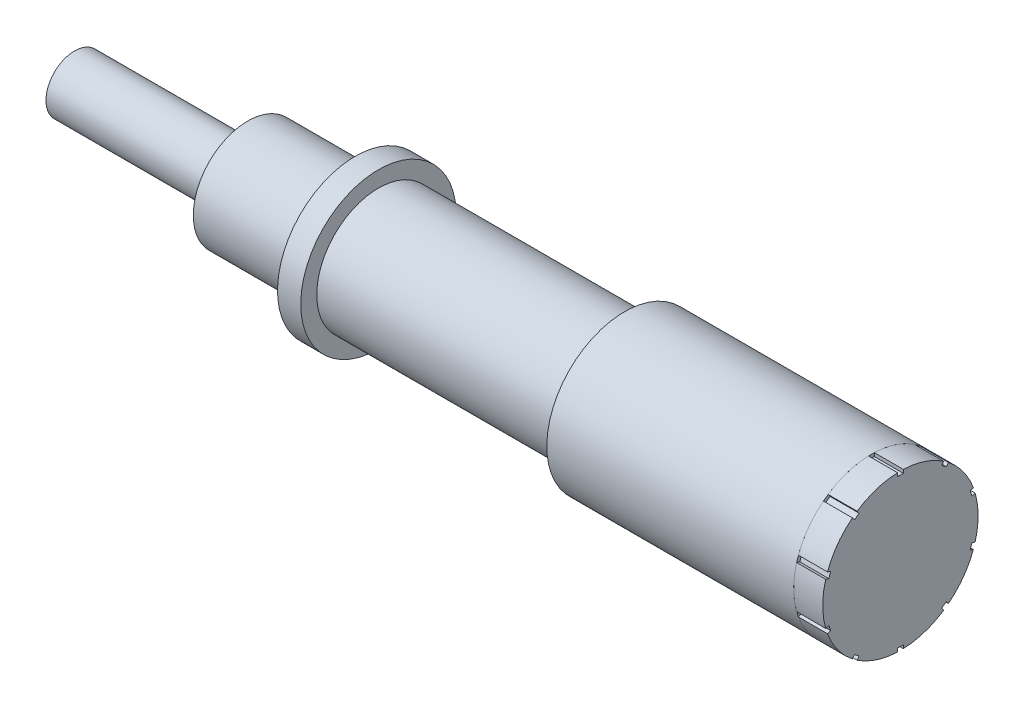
ISO-10303-21;
HEADER;
FILE_DESCRIPTION(('STEP AP214'),'2;1');
FILE_NAME('part.step','',(''),(''),'','','');
FILE_SCHEMA(('AUTOMOTIVE_DESIGN { 1 0 10303 214 1 1 1 1 }'));
ENDSEC;
DATA;
#1=APPLICATION_CONTEXT('core data for automotive mechanical design processes');
#2=APPLICATION_PROTOCOL_DEFINITION('international standard','automotive_design',2000,#1);
#3=PRODUCT_CONTEXT('',#1,'mechanical');
#4=PRODUCT('Part','Part','',(#3));
#5=PRODUCT_RELATED_PRODUCT_CATEGORY('part','',(#4));
#6=PRODUCT_DEFINITION_FORMATION('','',#4);
#7=PRODUCT_DEFINITION_CONTEXT('part definition',#1,'design');
#8=PRODUCT_DEFINITION('design','',#6,#7);
#9=PRODUCT_DEFINITION_SHAPE('','',#8);
#10=(LENGTH_UNIT() NAMED_UNIT(*) SI_UNIT(.MILLI.,.METRE.));
#11=(NAMED_UNIT(*) PLANE_ANGLE_UNIT() SI_UNIT($,.RADIAN.));
#12=(NAMED_UNIT(*) SI_UNIT($,.STERADIAN.) SOLID_ANGLE_UNIT());
#13=UNCERTAINTY_MEASURE_WITH_UNIT(LENGTH_MEASURE(1.E-05),#10,'distance_accuracy_value','');
#14=(GEOMETRIC_REPRESENTATION_CONTEXT(3) GLOBAL_UNCERTAINTY_ASSIGNED_CONTEXT((#13)) GLOBAL_UNIT_ASSIGNED_CONTEXT((#10,
#11,#12)) REPRESENTATION_CONTEXT('',''));
#15=CARTESIAN_POINT('',(0.,0.,0.));
#16=DIRECTION('',(0.,0.,1.));
#17=DIRECTION('',(1.,0.,0.));
#18=AXIS2_PLACEMENT_3D('',#15,#16,#17);
#19=CARTESIAN_POINT('',(63.4238,0.,0.));
#20=DIRECTION('',(-1.,0.,0.));
#21=DIRECTION('',(0.,0.,1.));
#22=AXIS2_PLACEMENT_3D('',#19,#20,#21);
#23=CYLINDRICAL_SURFACE('',#22,6.7945);
#24=CARTESIAN_POINT('',(63.4238,0.,0.));
#25=DIRECTION('',(1.,0.,0.));
#26=DIRECTION('',(0.,0.,-1.));
#27=AXIS2_PLACEMENT_3D('',#24,#25,#26);
#28=CIRCLE('',#27,6.7945);
#29=CARTESIAN_POINT('',(63.4238,5.64232113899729,-3.78542499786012));
#30=VERTEX_POINT('',#29);
#31=CARTESIAN_POINT('',(63.4238,6.78975067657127,-0.254));
#32=VERTEX_POINT('',#31);
#33=EDGE_CURVE('E339',#30,#32,#28,.T.);
#34=ORIENTED_EDGE('',*,*,#33,.F.);
#35=DIRECTION('',(-1.,0.,0.));
#36=VECTOR('',#35,1.);
#37=CARTESIAN_POINT('',(63.4238,5.6423211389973,-3.78542499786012));
#38=LINE('',#37,#36);
#39=CARTESIAN_POINT('',(60.8838,5.64232113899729,-3.78542499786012));
#40=VERTEX_POINT('',#39);
#41=EDGE_CURVE('E410',#30,#40,#38,.T.);
#42=ORIENTED_EDGE('',*,*,#41,.T.);
#43=CARTESIAN_POINT('',(60.8838,0.,0.));
#44=DIRECTION('',(1.,0.,0.));
#45=DIRECTION('',(0.,0.,-1.));
#46=AXIS2_PLACEMENT_3D('',#43,#44,#45);
#47=CIRCLE('',#46,6.7945);
#48=CARTESIAN_POINT('',(60.8838,6.78975067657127,-0.254));
#49=VERTEX_POINT('',#48);
#50=EDGE_CURVE('E321',#40,#49,#47,.T.);
#51=ORIENTED_EDGE('',*,*,#50,.T.);
#52=DIRECTION('',(-1.,0.,0.));
#53=VECTOR('',#52,1.);
#54=CARTESIAN_POINT('',(63.4238,6.78975067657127,-0.254));
#55=LINE('',#54,#53);
#56=EDGE_CURVE('E334',#49,#32,#55,.F.);
#57=ORIENTED_EDGE('',*,*,#56,.T.);
#58=EDGE_LOOP('',(#34,#42,#51,#57));
#59=FACE_BOUND('',#58,.T.);
#60=ADVANCED_FACE('F45',(#59),#23,.T.);
#61=CARTESIAN_POINT('',(60.8838,2.33971670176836,-6.37894630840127));
#62=VERTEX_POINT('',#61);
#63=CARTESIAN_POINT('',(60.8838,5.34372623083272,-4.1964056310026));
#64=VERTEX_POINT('',#63);
#65=EDGE_CURVE('E327',#62,#64,#47,.T.);
#66=ORIENTED_EDGE('',*,*,#65,.T.);
#67=DIRECTION('',(-1.,0.,0.));
#68=VECTOR('',#67,1.);
#69=CARTESIAN_POINT('',(63.4238,5.34372623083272,-4.1964056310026));
#70=LINE('',#69,#68);
#71=CARTESIAN_POINT('',(63.4238,5.34372623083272,-4.1964056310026));
#72=VERTEX_POINT('',#71);
#73=EDGE_CURVE('E638',#64,#72,#70,.F.);
#74=ORIENTED_EDGE('',*,*,#73,.T.);
#75=CARTESIAN_POINT('',(63.4238,2.33971670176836,-6.37894630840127));
#76=VERTEX_POINT('',#75);
#77=EDGE_CURVE('E344',#76,#72,#28,.T.);
#78=ORIENTED_EDGE('',*,*,#77,.F.);
#79=DIRECTION('',(-1.,0.,0.));
#80=VECTOR('',#79,1.);
#81=CARTESIAN_POINT('',(63.4238,2.33971670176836,-6.37894630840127));
#82=LINE('',#81,#80);
#83=EDGE_CURVE('E416',#76,#62,#82,.T.);
#84=ORIENTED_EDGE('',*,*,#83,.T.);
#85=EDGE_LOOP('',(#66,#74,#78,#84));
#86=FACE_BOUND('',#85,.T.);
#87=ADVANCED_FACE('F636',(#86),#23,.T.);
#88=CARTESIAN_POINT('',(60.8838,-1.85657999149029,-6.53592694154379));
#89=VERTEX_POINT('',#88);
#90=CARTESIAN_POINT('',(60.8838,1.85657999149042,-6.53592694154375));
#91=VERTEX_POINT('',#90);
#92=EDGE_CURVE('E332',#89,#91,#47,.T.);
#93=ORIENTED_EDGE('',*,*,#92,.T.);
#94=DIRECTION('',(-1.,0.,0.));
#95=VECTOR('',#94,1.);
#96=CARTESIAN_POINT('',(63.4238,1.85657999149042,-6.53592694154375));
#97=LINE('',#96,#95);
#98=CARTESIAN_POINT('',(63.4238,1.85657999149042,-6.53592694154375));
#99=VERTEX_POINT('',#98);
#100=EDGE_CURVE('E388',#91,#99,#97,.F.);
#101=ORIENTED_EDGE('',*,*,#100,.T.);
#102=CARTESIAN_POINT('',(63.4238,-1.85657999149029,-6.53592694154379));
#103=VERTEX_POINT('',#102);
#104=EDGE_CURVE('E622',#103,#99,#28,.T.);
#105=ORIENTED_EDGE('',*,*,#104,.F.);
#106=DIRECTION('',(-1.,0.,0.));
#107=VECTOR('',#106,1.);
#108=CARTESIAN_POINT('',(63.4238,-1.85657999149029,-6.53592694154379));
#109=LINE('',#108,#107);
#110=EDGE_CURVE('E390',#103,#89,#109,.T.);
#111=ORIENTED_EDGE('',*,*,#110,.T.);
#112=EDGE_LOOP('',(#93,#101,#105,#111));
#113=FACE_BOUND('',#112,.T.);
#114=ADVANCED_FACE('F386',(#113),#23,.T.);
#115=CARTESIAN_POINT('',(60.8838,-5.34372623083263,-4.19640563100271));
#116=VERTEX_POINT('',#115);
#117=CARTESIAN_POINT('',(60.8838,-2.33971670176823,-6.37894630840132));
#118=VERTEX_POINT('',#117);
#119=EDGE_CURVE('E371',#116,#118,#47,.T.);
#120=ORIENTED_EDGE('',*,*,#119,.T.);
#121=DIRECTION('',(-1.,0.,0.));
#122=VECTOR('',#121,1.);
#123=CARTESIAN_POINT('',(63.4238,-2.33971670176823,-6.37894630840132));
#124=LINE('',#123,#122);
#125=CARTESIAN_POINT('',(63.4238,-2.33971670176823,-6.37894630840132));
#126=VERTEX_POINT('',#125);
#127=EDGE_CURVE('E434',#118,#126,#124,.F.);
#128=ORIENTED_EDGE('',*,*,#127,.T.);
#129=CARTESIAN_POINT('',(63.4238,-5.34372623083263,-4.19640563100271));
#130=VERTEX_POINT('',#129);
#131=EDGE_CURVE('E617',#130,#126,#28,.T.);
#132=ORIENTED_EDGE('',*,*,#131,.F.);
#133=DIRECTION('',(-1.,0.,0.));
#134=VECTOR('',#133,1.);
#135=CARTESIAN_POINT('',(63.4238,-5.34372623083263,-4.19640563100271));
#136=LINE('',#135,#134);
#137=EDGE_CURVE('E459',#130,#116,#136,.T.);
#138=ORIENTED_EDGE('',*,*,#137,.T.);
#139=EDGE_LOOP('',(#120,#128,#132,#138));
#140=FACE_BOUND('',#139,.T.);
#141=ADVANCED_FACE('F713',(#140),#23,.T.);
#142=CARTESIAN_POINT('',(60.8838,-6.78975067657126,-0.254));
#143=VERTEX_POINT('',#142);
#144=CARTESIAN_POINT('',(60.8838,-5.64232113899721,-3.78542499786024));
#145=VERTEX_POINT('',#144);
#146=EDGE_CURVE('E365',#143,#145,#47,.T.);
#147=ORIENTED_EDGE('',*,*,#146,.T.);
#148=DIRECTION('',(-1.,0.,0.));
#149=VECTOR('',#148,1.);
#150=CARTESIAN_POINT('',(63.4238,-5.6423211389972,-3.78542499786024));
#151=LINE('',#150,#149);
#152=CARTESIAN_POINT('',(63.4238,-5.64232113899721,-3.78542499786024));
#153=VERTEX_POINT('',#152);
#154=EDGE_CURVE('E455',#145,#153,#151,.F.);
#155=ORIENTED_EDGE('',*,*,#154,.T.);
#156=CARTESIAN_POINT('',(63.4238,-6.78975067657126,-0.254));
#157=VERTEX_POINT('',#156);
#158=EDGE_CURVE('E612',#157,#153,#28,.T.);
#159=ORIENTED_EDGE('',*,*,#158,.F.);
#160=DIRECTION('',(-1.,0.,0.));
#161=VECTOR('',#160,1.);
#162=CARTESIAN_POINT('',(63.4238,-6.78975067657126,-0.254));
#163=LINE('',#162,#161);
#164=EDGE_CURVE('E481',#157,#143,#163,.T.);
#165=ORIENTED_EDGE('',*,*,#164,.T.);
#166=EDGE_LOOP('',(#147,#155,#159,#165));
#167=FACE_BOUND('',#166,.T.);
#168=ADVANCED_FACE('F704',(#167),#23,.T.);
#169=CARTESIAN_POINT('',(60.8838,-5.64232113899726,3.78542499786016));
#170=VERTEX_POINT('',#169);
#171=CARTESIAN_POINT('',(60.8838,-6.78975067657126,0.254));
#172=VERTEX_POINT('',#171);
#173=EDGE_CURVE('E359',#170,#172,#47,.T.);
#174=ORIENTED_EDGE('',*,*,#173,.T.);
#175=DIRECTION('',(-1.,0.,0.));
#176=VECTOR('',#175,1.);
#177=CARTESIAN_POINT('',(63.4238,-6.78975067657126,0.254));
#178=LINE('',#177,#176);
#179=CARTESIAN_POINT('',(63.4238,-6.78975067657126,0.254));
#180=VERTEX_POINT('',#179);
#181=EDGE_CURVE('E477',#172,#180,#178,.F.);
#182=ORIENTED_EDGE('',*,*,#181,.T.);
#183=CARTESIAN_POINT('',(63.4238,-5.64232113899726,3.78542499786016));
#184=VERTEX_POINT('',#183);
#185=EDGE_CURVE('E607',#184,#180,#28,.T.);
#186=ORIENTED_EDGE('',*,*,#185,.F.);
#187=DIRECTION('',(-1.,0.,0.));
#188=VECTOR('',#187,1.);
#189=CARTESIAN_POINT('',(63.4238,-5.64232113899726,3.78542499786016));
#190=LINE('',#189,#188);
#191=EDGE_CURVE('E503',#184,#170,#190,.T.);
#192=ORIENTED_EDGE('',*,*,#191,.T.);
#193=EDGE_LOOP('',(#174,#182,#186,#192));
#194=FACE_BOUND('',#193,.T.);
#195=ADVANCED_FACE('F695',(#194),#23,.T.);
#196=CARTESIAN_POINT('',(60.8838,-2.33971670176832,6.37894630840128));
#197=VERTEX_POINT('',#196);
#198=CARTESIAN_POINT('',(60.8838,-5.34372623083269,4.19640563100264));
#199=VERTEX_POINT('',#198);
#200=EDGE_CURVE('E353',#197,#199,#47,.T.);
#201=ORIENTED_EDGE('',*,*,#200,.T.);
#202=DIRECTION('',(-1.,0.,0.));
#203=VECTOR('',#202,1.);
#204=CARTESIAN_POINT('',(63.4238,-5.34372623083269,4.19640563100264));
#205=LINE('',#204,#203);
#206=CARTESIAN_POINT('',(63.4238,-5.34372623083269,4.19640563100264));
#207=VERTEX_POINT('',#206);
#208=EDGE_CURVE('E499',#199,#207,#205,.F.);
#209=ORIENTED_EDGE('',*,*,#208,.T.);
#210=CARTESIAN_POINT('',(63.4238,-2.33971670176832,6.37894630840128));
#211=VERTEX_POINT('',#210);
#212=EDGE_CURVE('E602',#211,#207,#28,.T.);
#213=ORIENTED_EDGE('',*,*,#212,.F.);
#214=DIRECTION('',(-1.,0.,0.));
#215=VECTOR('',#214,1.);
#216=CARTESIAN_POINT('',(63.4238,-2.33971670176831,6.37894630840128));
#217=LINE('',#216,#215);
#218=EDGE_CURVE('E525',#211,#197,#217,.T.);
#219=ORIENTED_EDGE('',*,*,#218,.T.);
#220=EDGE_LOOP('',(#201,#209,#213,#219));
#221=FACE_BOUND('',#220,.T.);
#222=ADVANCED_FACE('F686',(#221),#23,.T.);
#223=CARTESIAN_POINT('',(60.8838,1.85657999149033,6.53592694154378));
#224=VERTEX_POINT('',#223);
#225=CARTESIAN_POINT('',(60.8838,-1.85657999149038,6.53592694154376));
#226=VERTEX_POINT('',#225);
#227=EDGE_CURVE('E347',#224,#226,#47,.T.);
#228=ORIENTED_EDGE('',*,*,#227,.T.);
#229=DIRECTION('',(-1.,0.,0.));
#230=VECTOR('',#229,1.);
#231=CARTESIAN_POINT('',(63.4238,-1.85657999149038,6.53592694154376));
#232=LINE('',#231,#230);
#233=CARTESIAN_POINT('',(63.4238,-1.85657999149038,6.53592694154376));
#234=VERTEX_POINT('',#233);
#235=EDGE_CURVE('E521',#226,#234,#232,.F.);
#236=ORIENTED_EDGE('',*,*,#235,.T.);
#237=CARTESIAN_POINT('',(63.4238,1.85657999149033,6.53592694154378));
#238=VERTEX_POINT('',#237);
#239=EDGE_CURVE('E597',#238,#234,#28,.T.);
#240=ORIENTED_EDGE('',*,*,#239,.F.);
#241=DIRECTION('',(-1.,0.,0.));
#242=VECTOR('',#241,1.);
#243=CARTESIAN_POINT('',(63.4238,1.85657999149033,6.53592694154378));
#244=LINE('',#243,#242);
#245=EDGE_CURVE('E547',#238,#224,#244,.T.);
#246=ORIENTED_EDGE('',*,*,#245,.T.);
#247=EDGE_LOOP('',(#228,#236,#240,#246));
#248=FACE_BOUND('',#247,.T.);
#249=ADVANCED_FACE('F677',(#248),#23,.T.);
#250=CARTESIAN_POINT('',(60.8838,5.34372623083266,4.19640563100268));
#251=VERTEX_POINT('',#250);
#252=CARTESIAN_POINT('',(60.8838,2.33971670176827,6.3789463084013));
#253=VERTEX_POINT('',#252);
#254=EDGE_CURVE('E340',#251,#253,#47,.T.);
#255=ORIENTED_EDGE('',*,*,#254,.T.);
#256=DIRECTION('',(-1.,0.,0.));
#257=VECTOR('',#256,1.);
#258=CARTESIAN_POINT('',(63.4238,2.33971670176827,6.3789463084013));
#259=LINE('',#258,#257);
#260=CARTESIAN_POINT('',(63.4238,2.33971670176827,6.3789463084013));
#261=VERTEX_POINT('',#260);
#262=EDGE_CURVE('E543',#253,#261,#259,.F.);
#263=ORIENTED_EDGE('',*,*,#262,.T.);
#264=CARTESIAN_POINT('',(63.4238,5.34372623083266,4.19640563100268));
#265=VERTEX_POINT('',#264);
#266=EDGE_CURVE('E589',#265,#261,#28,.T.);
#267=ORIENTED_EDGE('',*,*,#266,.F.);
#268=DIRECTION('',(-1.,0.,0.));
#269=VECTOR('',#268,1.);
#270=CARTESIAN_POINT('',(63.4238,5.34372623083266,4.19640563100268));
#271=LINE('',#270,#269);
#272=EDGE_CURVE('E569',#265,#251,#271,.T.);
#273=ORIENTED_EDGE('',*,*,#272,.T.);
#274=EDGE_LOOP('',(#255,#263,#267,#273));
#275=FACE_BOUND('',#274,.T.);
#276=ADVANCED_FACE('F668',(#275),#23,.T.);
#277=CARTESIAN_POINT('',(60.8838,6.78975067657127,0.254));
#278=VERTEX_POINT('',#277);
#279=CARTESIAN_POINT('',(60.8838,5.64232113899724,3.78542499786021));
#280=VERTEX_POINT('',#279);
#281=EDGE_CURVE('E330',#278,#280,#47,.T.);
#282=ORIENTED_EDGE('',*,*,#281,.T.);
#283=DIRECTION('',(-1.,0.,0.));
#284=VECTOR('',#283,1.);
#285=CARTESIAN_POINT('',(63.4238,5.64232113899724,3.78542499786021));
#286=LINE('',#285,#284);
#287=CARTESIAN_POINT('',(63.4238,5.64232113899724,3.78542499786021));
#288=VERTEX_POINT('',#287);
#289=EDGE_CURVE('E565',#280,#288,#286,.F.);
#290=ORIENTED_EDGE('',*,*,#289,.T.);
#291=CARTESIAN_POINT('',(63.4238,6.78975067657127,0.254));
#292=VERTEX_POINT('',#291);
#293=EDGE_CURVE('E345',#292,#288,#28,.T.);
#294=ORIENTED_EDGE('',*,*,#293,.F.);
#295=DIRECTION('',(-1.,0.,0.));
#296=VECTOR('',#295,1.);
#297=CARTESIAN_POINT('',(63.4238,6.78975067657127,0.254));
#298=LINE('',#297,#296);
#299=EDGE_CURVE('E328',#292,#278,#298,.T.);
#300=ORIENTED_EDGE('',*,*,#299,.T.);
#301=EDGE_LOOP('',(#282,#290,#294,#300));
#302=FACE_BOUND('',#301,.T.);
#303=ADVANCED_FACE('F47',(#302),#23,.T.);
#304=CARTESIAN_POINT('',(63.4238,0.,0.));
#305=DIRECTION('',(1.,0.,0.));
#306=DIRECTION('',(0.,0.,-1.));
#307=AXIS2_PLACEMENT_3D('',#304,#305,#306);
#308=PLANE('',#307);
#309=DIRECTION('',(0.,-0.809016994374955,0.587785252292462));
#310=VECTOR('',#309,1.);
#311=CARTESIAN_POINT('',(63.4238,5.40221871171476,-3.61098037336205));
#312=LINE('',#311,#310);
#313=CARTESIAN_POINT('',(63.4238,5.40221871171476,-3.61098037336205));
#314=VERTEX_POINT('',#313);
#315=EDGE_CURVE('E306',#30,#314,#312,.T.);
#316=ORIENTED_EDGE('',*,*,#315,.F.);
#317=ORIENTED_EDGE('',*,*,#33,.T.);
#318=DIRECTION('',(0.,1.,0.));
#319=VECTOR('',#318,1.);
#320=CARTESIAN_POINT('',(63.4238,6.49296775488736,-0.254));
#321=LINE('',#320,#319);
#322=CARTESIAN_POINT('',(63.4238,6.49296775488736,-0.254));
#323=VERTEX_POINT('',#322);
#324=EDGE_CURVE('E574',#323,#32,#321,.T.);
#325=ORIENTED_EDGE('',*,*,#324,.F.);
#326=DIRECTION('',(0.,0.,-1.));
#327=VECTOR('',#326,1.);
#328=CARTESIAN_POINT('',(63.4238,6.49296775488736,0.254));
#329=LINE('',#328,#327);
#330=CARTESIAN_POINT('',(63.4238,6.49296775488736,0.254));
#331=VERTEX_POINT('',#330);
#332=EDGE_CURVE('E578',#331,#323,#329,.T.);
#333=ORIENTED_EDGE('',*,*,#332,.F.);
#334=DIRECTION('',(0.,-1.,0.));
#335=VECTOR('',#334,1.);
#336=CARTESIAN_POINT('',(63.4238,6.49296775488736,0.254));
#337=LINE('',#336,#335);
#338=EDGE_CURVE('E571',#292,#331,#337,.T.);
#339=ORIENTED_EDGE('',*,*,#338,.F.);
#340=ORIENTED_EDGE('',*,*,#293,.T.);
#341=DIRECTION('',(0.,0.809016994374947,0.587785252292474));
#342=VECTOR('',#341,1.);
#343=CARTESIAN_POINT('',(63.4238,5.40221871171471,3.61098037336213));
#344=LINE('',#343,#342);
#345=CARTESIAN_POINT('',(63.4238,5.40221871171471,3.61098037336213));
#346=VERTEX_POINT('',#345);
#347=EDGE_CURVE('E554',#346,#288,#344,.T.);
#348=ORIENTED_EDGE('',*,*,#347,.F.);
#349=DIRECTION('',(0.,0.587785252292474,-0.809016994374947));
#350=VECTOR('',#349,1.);
#351=CARTESIAN_POINT('',(63.4238,5.10362380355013,4.0219610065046));
#352=LINE('',#351,#350);
#353=CARTESIAN_POINT('',(63.4238,5.10362380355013,4.0219610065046));
#354=VERTEX_POINT('',#353);
#355=EDGE_CURVE('E559',#354,#346,#352,.T.);
#356=ORIENTED_EDGE('',*,*,#355,.F.);
#357=DIRECTION('',(0.,-0.809016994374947,-0.587785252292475));
#358=VECTOR('',#357,1.);
#359=CARTESIAN_POINT('',(63.4238,5.10362380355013,4.0219610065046));
#360=LINE('',#359,#358);
#361=EDGE_CURVE('E549',#265,#354,#360,.T.);
#362=ORIENTED_EDGE('',*,*,#361,.F.);
#363=ORIENTED_EDGE('',*,*,#266,.T.);
#364=DIRECTION('',(0.,0.309016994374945,0.951056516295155));
#365=VECTOR('',#364,1.);
#366=CARTESIAN_POINT('',(63.4238,2.24800573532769,6.09668897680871));
#367=LINE('',#366,#365);
#368=CARTESIAN_POINT('',(63.4238,2.24800573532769,6.09668897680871));
#369=VERTEX_POINT('',#368);
#370=EDGE_CURVE('E532',#369,#261,#367,.T.);
#371=ORIENTED_EDGE('',*,*,#370,.F.);
#372=DIRECTION('',(0.,0.951056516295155,-0.309016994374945));
#373=VECTOR('',#372,1.);
#374=CARTESIAN_POINT('',(63.4238,1.76486902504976,6.25366960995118));
#375=LINE('',#374,#373);
#376=CARTESIAN_POINT('',(63.4238,1.76486902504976,6.25366960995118));
#377=VERTEX_POINT('',#376);
#378=EDGE_CURVE('E537',#377,#369,#375,.T.);
#379=ORIENTED_EDGE('',*,*,#378,.F.);
#380=DIRECTION('',(0.,-0.309016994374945,-0.951056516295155));
#381=VECTOR('',#380,1.);
#382=CARTESIAN_POINT('',(63.4238,1.76486902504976,6.25366960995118));
#383=LINE('',#382,#381);
#384=EDGE_CURVE('E527',#238,#377,#383,.T.);
#385=ORIENTED_EDGE('',*,*,#384,.F.);
#386=ORIENTED_EDGE('',*,*,#239,.T.);
#387=DIRECTION('',(0.,-0.309016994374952,0.951056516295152));
#388=VECTOR('',#387,1.);
#389=CARTESIAN_POINT('',(63.4238,-1.7648690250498,6.25366960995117));
#390=LINE('',#389,#388);
#391=CARTESIAN_POINT('',(63.4238,-1.7648690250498,6.25366960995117));
#392=VERTEX_POINT('',#391);
#393=EDGE_CURVE('E510',#392,#234,#390,.T.);
#394=ORIENTED_EDGE('',*,*,#393,.F.);
#395=DIRECTION('',(0.,0.951056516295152,0.309016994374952));
#396=VECTOR('',#395,1.);
#397=CARTESIAN_POINT('',(63.4238,-2.24800573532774,6.09668897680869));
#398=LINE('',#397,#396);
#399=CARTESIAN_POINT('',(63.4238,-2.24800573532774,6.09668897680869));
#400=VERTEX_POINT('',#399);
#401=EDGE_CURVE('E515',#400,#392,#398,.T.);
#402=ORIENTED_EDGE('',*,*,#401,.F.);
#403=DIRECTION('',(0.,0.309016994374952,-0.951056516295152));
#404=VECTOR('',#403,1.);
#405=CARTESIAN_POINT('',(63.4238,-2.24800573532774,6.09668897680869));
#406=LINE('',#405,#404);
#407=EDGE_CURVE('E505',#211,#400,#406,.T.);
#408=ORIENTED_EDGE('',*,*,#407,.F.);
#409=ORIENTED_EDGE('',*,*,#212,.T.);
#410=DIRECTION('',(0.,-0.809016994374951,0.587785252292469));
#411=VECTOR('',#410,1.);
#412=CARTESIAN_POINT('',(63.4238,-5.10362380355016,4.02196100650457));
#413=LINE('',#412,#411);
#414=CARTESIAN_POINT('',(63.4238,-5.10362380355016,4.02196100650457));
#415=VERTEX_POINT('',#414);
#416=EDGE_CURVE('E488',#415,#207,#413,.T.);
#417=ORIENTED_EDGE('',*,*,#416,.F.);
#418=DIRECTION('',(0.,0.587785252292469,0.809016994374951));
#419=VECTOR('',#418,1.);
#420=CARTESIAN_POINT('',(63.4238,-5.40221871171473,3.61098037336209));
#421=LINE('',#420,#419);
#422=CARTESIAN_POINT('',(63.4238,-5.40221871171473,3.61098037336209));
#423=VERTEX_POINT('',#422);
#424=EDGE_CURVE('E493',#423,#415,#421,.T.);
#425=ORIENTED_EDGE('',*,*,#424,.F.);
#426=DIRECTION('',(0.,0.809016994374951,-0.587785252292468));
#427=VECTOR('',#426,1.);
#428=CARTESIAN_POINT('',(63.4238,-5.40221871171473,3.61098037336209));
#429=LINE('',#428,#427);
#430=EDGE_CURVE('E483',#184,#423,#429,.T.);
#431=ORIENTED_EDGE('',*,*,#430,.F.);
#432=ORIENTED_EDGE('',*,*,#185,.T.);
#433=DIRECTION('',(0.,-1.,0.));
#434=VECTOR('',#433,1.);
#435=CARTESIAN_POINT('',(63.4238,-6.49296775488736,0.254));
#436=LINE('',#435,#434);
#437=CARTESIAN_POINT('',(63.4238,-6.49296775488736,0.254));
#438=VERTEX_POINT('',#437);
#439=EDGE_CURVE('E466',#438,#180,#436,.T.);
#440=ORIENTED_EDGE('',*,*,#439,.F.);
#441=DIRECTION('',(0.,0.,1.));
#442=VECTOR('',#441,1.);
#443=CARTESIAN_POINT('',(63.4238,-6.49296775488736,-0.254));
#444=LINE('',#443,#442);
#445=CARTESIAN_POINT('',(63.4238,-6.49296775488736,-0.254));
#446=VERTEX_POINT('',#445);
#447=EDGE_CURVE('E471',#446,#438,#444,.T.);
#448=ORIENTED_EDGE('',*,*,#447,.F.);
#449=DIRECTION('',(0.,1.,0.));
#450=VECTOR('',#449,1.);
#451=CARTESIAN_POINT('',(63.4238,-6.49296775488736,-0.254));
#452=LINE('',#451,#450);
#453=EDGE_CURVE('E461',#157,#446,#452,.T.);
#454=ORIENTED_EDGE('',*,*,#453,.F.);
#455=ORIENTED_EDGE('',*,*,#158,.T.);
#456=DIRECTION('',(0.,-0.809016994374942,-0.58778525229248));
#457=VECTOR('',#456,1.);
#458=CARTESIAN_POINT('',(63.4238,-5.40221871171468,-3.61098037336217));
#459=LINE('',#458,#457);
#460=CARTESIAN_POINT('',(63.4238,-5.40221871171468,-3.61098037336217));
#461=VERTEX_POINT('',#460);
#462=EDGE_CURVE('E444',#461,#153,#459,.T.);
#463=ORIENTED_EDGE('',*,*,#462,.F.);
#464=DIRECTION('',(0.,-0.58778525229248,0.809016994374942));
#465=VECTOR('',#464,1.);
#466=CARTESIAN_POINT('',(63.4238,-5.1036238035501,-4.02196100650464));
#467=LINE('',#466,#465);
#468=CARTESIAN_POINT('',(63.4238,-5.1036238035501,-4.02196100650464));
#469=VERTEX_POINT('',#468);
#470=EDGE_CURVE('E449',#469,#461,#467,.T.);
#471=ORIENTED_EDGE('',*,*,#470,.F.);
#472=DIRECTION('',(0.,0.809016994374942,0.58778525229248));
#473=VECTOR('',#472,1.);
#474=CARTESIAN_POINT('',(63.4238,-5.1036238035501,-4.02196100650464));
#475=LINE('',#474,#473);
#476=EDGE_CURVE('E439',#130,#469,#475,.T.);
#477=ORIENTED_EDGE('',*,*,#476,.F.);
#478=ORIENTED_EDGE('',*,*,#131,.T.);
#479=DIRECTION('',(0.,-0.309016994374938,-0.951056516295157));
#480=VECTOR('',#479,1.);
#481=CARTESIAN_POINT('',(63.4238,-2.24800573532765,-6.09668897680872));
#482=LINE('',#481,#480);
#483=CARTESIAN_POINT('',(63.4238,-2.24800573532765,-6.09668897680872));
#484=VERTEX_POINT('',#483);
#485=EDGE_CURVE('E423',#484,#126,#482,.T.);
#486=ORIENTED_EDGE('',*,*,#485,.F.);
#487=DIRECTION('',(0.,-0.951056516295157,0.309016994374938));
#488=VECTOR('',#487,1.);
#489=CARTESIAN_POINT('',(63.4238,-1.76486902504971,-6.25366960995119));
#490=LINE('',#489,#488);
#491=CARTESIAN_POINT('',(63.4238,-1.76486902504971,-6.25366960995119));
#492=VERTEX_POINT('',#491);
#493=EDGE_CURVE('E428',#492,#484,#490,.T.);
#494=ORIENTED_EDGE('',*,*,#493,.F.);
#495=DIRECTION('',(0.,0.309016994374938,0.951056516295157));
#496=VECTOR('',#495,1.);
#497=CARTESIAN_POINT('',(63.4238,-1.76486902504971,-6.25366960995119));
#498=LINE('',#497,#496);
#499=EDGE_CURVE('E419',#103,#492,#498,.T.);
#500=ORIENTED_EDGE('',*,*,#499,.F.);
#501=ORIENTED_EDGE('',*,*,#104,.T.);
#502=DIRECTION('',(0.,0.309016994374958,-0.95105651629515));
#503=VECTOR('',#502,1.);
#504=CARTESIAN_POINT('',(63.4238,1.76486902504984,-6.25366960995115));
#505=LINE('',#504,#503);
#506=CARTESIAN_POINT('',(63.4238,1.76486902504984,-6.25366960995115));
#507=VERTEX_POINT('',#506);
#508=EDGE_CURVE('E403',#507,#99,#505,.T.);
#509=ORIENTED_EDGE('',*,*,#508,.F.);
#510=DIRECTION('',(0.,-0.95105651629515,-0.309016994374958));
#511=VECTOR('',#510,1.);
#512=CARTESIAN_POINT('',(63.4238,2.24800573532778,-6.09668897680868));
#513=LINE('',#512,#511);
#514=CARTESIAN_POINT('',(63.4238,2.24800573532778,-6.09668897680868));
#515=VERTEX_POINT('',#514);
#516=EDGE_CURVE('E409',#515,#507,#513,.T.);
#517=ORIENTED_EDGE('',*,*,#516,.F.);
#518=DIRECTION('',(0.,-0.309016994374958,0.95105651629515));
#519=VECTOR('',#518,1.);
#520=CARTESIAN_POINT('',(63.4238,2.24800573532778,-6.09668897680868));
#521=LINE('',#520,#519);
#522=EDGE_CURVE('E407',#76,#515,#521,.T.);
#523=ORIENTED_EDGE('',*,*,#522,.F.);
#524=ORIENTED_EDGE('',*,*,#77,.T.);
#525=DIRECTION('',(0.,0.809016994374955,-0.587785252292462));
#526=VECTOR('',#525,1.);
#527=CARTESIAN_POINT('',(63.4238,5.10362380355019,-4.02196100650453));
#528=LINE('',#527,#526);
#529=CARTESIAN_POINT('',(63.4238,5.10362380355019,-4.02196100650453));
#530=VERTEX_POINT('',#529);
#531=EDGE_CURVE('E316',#530,#72,#528,.T.);
#532=ORIENTED_EDGE('',*,*,#531,.F.);
#533=DIRECTION('',(0.,-0.587785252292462,-0.809016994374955));
#534=VECTOR('',#533,1.);
#535=CARTESIAN_POINT('',(63.4238,5.40221871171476,-3.61098037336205));
#536=LINE('',#535,#534);
#537=EDGE_CURVE('E643',#314,#530,#536,.T.);
#538=ORIENTED_EDGE('',*,*,#537,.F.);
#539=EDGE_LOOP('',(#316,#317,#325,#333,#339,#340,#348,#356,#362,#363,#371,#379,#385,#386,#394,
#402,#408,#409,#417,#425,#431,#432,#440,#448,#454,#455,#463,#471,#477,#478,#486,#494,#500,#501,
#509,#517,#523,#524,#532,#538));
#540=FACE_BOUND('',#539,.T.);
#541=ADVANCED_FACE('F632',(#540),#308,.T.);
#542=CARTESIAN_POINT('',(60.8838,0.,0.));
#543=DIRECTION('',(1.,0.,0.));
#544=DIRECTION('',(0.,0.,-1.));
#545=AXIS2_PLACEMENT_3D('',#542,#543,#544);
#546=PLANE('',#545);
#547=ORIENTED_EDGE('',*,*,#50,.F.);
#548=DIRECTION('',(0.,-0.809016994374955,0.587785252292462));
#549=VECTOR('',#548,1.);
#550=CARTESIAN_POINT('',(60.8838,0.149297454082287,0.205490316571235));
#551=LINE('',#550,#549);
#552=CARTESIAN_POINT('',(60.8838,5.40221871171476,-3.61098037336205));
#553=VERTEX_POINT('',#552);
#554=EDGE_CURVE('E12',#40,#553,#551,.T.);
#555=ORIENTED_EDGE('',*,*,#554,.T.);
#556=DIRECTION('',(0.,-0.587785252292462,-0.809016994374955));
#557=VECTOR('',#556,1.);
#558=CARTESIAN_POINT('',(60.8838,5.40221871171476,-3.61098037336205));
#559=LINE('',#558,#557);
#560=CARTESIAN_POINT('',(60.8838,5.10362380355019,-4.02196100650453));
#561=VERTEX_POINT('',#560);
#562=EDGE_CURVE('E313',#553,#561,#559,.T.);
#563=ORIENTED_EDGE('',*,*,#562,.T.);
#564=DIRECTION('',(0.,0.809016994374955,-0.587785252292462));
#565=VECTOR('',#564,1.);
#566=CARTESIAN_POINT('',(60.8838,5.10362380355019,-4.02196100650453));
#567=LINE('',#566,#565);
#568=EDGE_CURVE('E60',#561,#64,#567,.T.);
#569=ORIENTED_EDGE('',*,*,#568,.T.);
#570=ORIENTED_EDGE('',*,*,#65,.F.);
#571=DIRECTION('',(0.,-0.309016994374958,0.95105651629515));
#572=VECTOR('',#571,1.);
#573=CARTESIAN_POINT('',(60.8838,0.241568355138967,0.0784903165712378));
#574=LINE('',#573,#572);
#575=CARTESIAN_POINT('',(60.8838,2.24800573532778,-6.09668897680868));
#576=VERTEX_POINT('',#575);
#577=EDGE_CURVE('E53',#62,#576,#574,.T.);
#578=ORIENTED_EDGE('',*,*,#577,.T.);
#579=DIRECTION('',(0.,-0.95105651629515,-0.309016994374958));
#580=VECTOR('',#579,1.);
#581=CARTESIAN_POINT('',(60.8838,2.24800573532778,-6.09668897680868));
#582=LINE('',#581,#580);
#583=CARTESIAN_POINT('',(60.8838,1.76486902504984,-6.25366960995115));
#584=VERTEX_POINT('',#583);
#585=EDGE_CURVE('E397',#576,#584,#582,.T.);
#586=ORIENTED_EDGE('',*,*,#585,.T.);
#587=DIRECTION('',(0.,0.309016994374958,-0.95105651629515));
#588=VECTOR('',#587,1.);
#589=CARTESIAN_POINT('',(60.8838,1.76486902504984,-6.25366960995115));
#590=LINE('',#589,#588);
#591=EDGE_CURVE('E68',#584,#91,#590,.T.);
#592=ORIENTED_EDGE('',*,*,#591,.T.);
#593=ORIENTED_EDGE('',*,*,#92,.F.);
#594=DIRECTION('',(0.,0.309016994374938,0.951056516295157));
#595=VECTOR('',#594,1.);
#596=CARTESIAN_POINT('',(60.8838,0.241568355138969,-0.0784903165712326));
#597=LINE('',#596,#595);
#598=CARTESIAN_POINT('',(60.8838,-1.76486902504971,-6.25366960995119));
#599=VERTEX_POINT('',#598);
#600=EDGE_CURVE('E393',#89,#599,#597,.T.);
#601=ORIENTED_EDGE('',*,*,#600,.T.);
#602=DIRECTION('',(0.,-0.951056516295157,0.309016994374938));
#603=VECTOR('',#602,1.);
#604=CARTESIAN_POINT('',(60.8838,-1.76486902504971,-6.25366960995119));
#605=LINE('',#604,#603);
#606=CARTESIAN_POINT('',(60.8838,-2.24800573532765,-6.09668897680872));
#607=VERTEX_POINT('',#606);
#608=EDGE_CURVE('E420',#599,#607,#605,.T.);
#609=ORIENTED_EDGE('',*,*,#608,.T.);
#610=DIRECTION('',(0.,-0.309016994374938,-0.951056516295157));
#611=VECTOR('',#610,1.);
#612=CARTESIAN_POINT('',(60.8838,-2.24800573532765,-6.09668897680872));
#613=LINE('',#612,#611);
#614=EDGE_CURVE('E422',#607,#118,#613,.T.);
#615=ORIENTED_EDGE('',*,*,#614,.T.);
#616=ORIENTED_EDGE('',*,*,#119,.F.);
#617=DIRECTION('',(0.,0.809016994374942,0.58778525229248));
#618=VECTOR('',#617,1.);
#619=CARTESIAN_POINT('',(60.8838,0.149297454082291,-0.205490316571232));
#620=LINE('',#619,#618);
#621=CARTESIAN_POINT('',(60.8838,-5.1036238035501,-4.02196100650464));
#622=VERTEX_POINT('',#621);
#623=EDGE_CURVE('E647',#116,#622,#620,.T.);
#624=ORIENTED_EDGE('',*,*,#623,.T.);
#625=DIRECTION('',(0.,-0.58778525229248,0.809016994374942));
#626=VECTOR('',#625,1.);
#627=CARTESIAN_POINT('',(60.8838,-5.1036238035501,-4.02196100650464));
#628=LINE('',#627,#626);
#629=CARTESIAN_POINT('',(60.8838,-5.40221871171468,-3.61098037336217));
#630=VERTEX_POINT('',#629);
#631=EDGE_CURVE('E440',#622,#630,#628,.T.);
#632=ORIENTED_EDGE('',*,*,#631,.T.);
#633=DIRECTION('',(0.,-0.809016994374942,-0.58778525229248));
#634=VECTOR('',#633,1.);
#635=CARTESIAN_POINT('',(60.8838,-5.40221871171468,-3.61098037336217));
#636=LINE('',#635,#634);
#637=EDGE_CURVE('E443',#630,#145,#636,.T.);
#638=ORIENTED_EDGE('',*,*,#637,.T.);
#639=ORIENTED_EDGE('',*,*,#146,.F.);
#640=DIRECTION('',(0.,1.,0.));
#641=VECTOR('',#640,1.);
#642=CARTESIAN_POINT('',(60.8838,0.,-0.253999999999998));
#643=LINE('',#642,#641);
#644=CARTESIAN_POINT('',(60.8838,-6.49296775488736,-0.254));
#645=VERTEX_POINT('',#644);
#646=EDGE_CURVE('E652',#143,#645,#643,.T.);
#647=ORIENTED_EDGE('',*,*,#646,.T.);
#648=DIRECTION('',(0.,0.,1.));
#649=VECTOR('',#648,1.);
#650=CARTESIAN_POINT('',(60.8838,-6.49296775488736,-0.254));
#651=LINE('',#650,#649);
#652=CARTESIAN_POINT('',(60.8838,-6.49296775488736,0.254));
#653=VERTEX_POINT('',#652);
#654=EDGE_CURVE('E462',#645,#653,#651,.T.);
#655=ORIENTED_EDGE('',*,*,#654,.T.);
#656=DIRECTION('',(0.,-1.,0.));
#657=VECTOR('',#656,1.);
#658=CARTESIAN_POINT('',(60.8838,-6.49296775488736,0.254));
#659=LINE('',#658,#657);
#660=EDGE_CURVE('E465',#653,#172,#659,.T.);
#661=ORIENTED_EDGE('',*,*,#660,.T.);
#662=ORIENTED_EDGE('',*,*,#173,.F.);
#663=DIRECTION('',(0.,0.809016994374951,-0.587785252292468));
#664=VECTOR('',#663,1.);
#665=CARTESIAN_POINT('',(60.8838,-0.149297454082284,-0.205490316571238));
#666=LINE('',#665,#664);
#667=CARTESIAN_POINT('',(60.8838,-5.40221871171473,3.61098037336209));
#668=VERTEX_POINT('',#667);
#669=EDGE_CURVE('E655',#170,#668,#666,.T.);
#670=ORIENTED_EDGE('',*,*,#669,.T.);
#671=DIRECTION('',(0.,0.587785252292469,0.809016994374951));
#672=VECTOR('',#671,1.);
#673=CARTESIAN_POINT('',(60.8838,-5.40221871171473,3.61098037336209));
#674=LINE('',#673,#672);
#675=CARTESIAN_POINT('',(60.8838,-5.10362380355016,4.02196100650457));
#676=VERTEX_POINT('',#675);
#677=EDGE_CURVE('E484',#668,#676,#674,.T.);
#678=ORIENTED_EDGE('',*,*,#677,.T.);
#679=DIRECTION('',(0.,-0.809016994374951,0.587785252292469));
#680=VECTOR('',#679,1.);
#681=CARTESIAN_POINT('',(60.8838,-5.10362380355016,4.02196100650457));
#682=LINE('',#681,#680);
#683=EDGE_CURVE('E487',#676,#199,#682,.T.);
#684=ORIENTED_EDGE('',*,*,#683,.T.);
#685=ORIENTED_EDGE('',*,*,#200,.F.);
#686=DIRECTION('',(0.,0.309016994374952,-0.951056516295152));
#687=VECTOR('',#686,1.);
#688=CARTESIAN_POINT('',(60.8838,-0.241568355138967,-0.0784903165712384));
#689=LINE('',#688,#687);
#690=CARTESIAN_POINT('',(60.8838,-2.24800573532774,6.09668897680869));
#691=VERTEX_POINT('',#690);
#692=EDGE_CURVE('E658',#197,#691,#689,.T.);
#693=ORIENTED_EDGE('',*,*,#692,.T.);
#694=DIRECTION('',(0.,0.951056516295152,0.309016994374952));
#695=VECTOR('',#694,1.);
#696=CARTESIAN_POINT('',(60.8838,-2.24800573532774,6.09668897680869));
#697=LINE('',#696,#695);
#698=CARTESIAN_POINT('',(60.8838,-1.7648690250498,6.25366960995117));
#699=VERTEX_POINT('',#698);
#700=EDGE_CURVE('E506',#691,#699,#697,.T.);
#701=ORIENTED_EDGE('',*,*,#700,.T.);
#702=DIRECTION('',(0.,-0.309016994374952,0.951056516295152));
#703=VECTOR('',#702,1.);
#704=CARTESIAN_POINT('',(60.8838,-1.7648690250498,6.25366960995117));
#705=LINE('',#704,#703);
#706=EDGE_CURVE('E509',#699,#226,#705,.T.);
#707=ORIENTED_EDGE('',*,*,#706,.T.);
#708=ORIENTED_EDGE('',*,*,#227,.F.);
#709=DIRECTION('',(0.,-0.309016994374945,-0.951056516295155));
#710=VECTOR('',#709,1.);
#711=CARTESIAN_POINT('',(60.8838,-0.241568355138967,0.0784903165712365));
#712=LINE('',#711,#710);
#713=CARTESIAN_POINT('',(60.8838,1.76486902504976,6.25366960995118));
#714=VERTEX_POINT('',#713);
#715=EDGE_CURVE('E661',#224,#714,#712,.T.);
#716=ORIENTED_EDGE('',*,*,#715,.T.);
#717=DIRECTION('',(0.,0.951056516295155,-0.309016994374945));
#718=VECTOR('',#717,1.);
#719=CARTESIAN_POINT('',(60.8838,1.76486902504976,6.25366960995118));
#720=LINE('',#719,#718);
#721=CARTESIAN_POINT('',(60.8838,2.24800573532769,6.09668897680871));
#722=VERTEX_POINT('',#721);
#723=EDGE_CURVE('E528',#714,#722,#720,.T.);
#724=ORIENTED_EDGE('',*,*,#723,.T.);
#725=DIRECTION('',(0.,0.309016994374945,0.951056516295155));
#726=VECTOR('',#725,1.);
#727=CARTESIAN_POINT('',(60.8838,2.24800573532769,6.09668897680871));
#728=LINE('',#727,#726);
#729=EDGE_CURVE('E531',#722,#253,#728,.T.);
#730=ORIENTED_EDGE('',*,*,#729,.T.);
#731=ORIENTED_EDGE('',*,*,#254,.F.);
#732=DIRECTION('',(0.,-0.809016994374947,-0.587785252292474));
#733=VECTOR('',#732,1.);
#734=CARTESIAN_POINT('',(60.8838,-0.149297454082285,0.205490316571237));
#735=LINE('',#734,#733);
#736=CARTESIAN_POINT('',(60.8838,5.10362380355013,4.0219610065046));
#737=VERTEX_POINT('',#736);
#738=EDGE_CURVE('E595',#251,#737,#735,.T.);
#739=ORIENTED_EDGE('',*,*,#738,.T.);
#740=DIRECTION('',(0.,0.587785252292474,-0.809016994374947));
#741=VECTOR('',#740,1.);
#742=CARTESIAN_POINT('',(60.8838,5.10362380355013,4.0219610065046));
#743=LINE('',#742,#741);
#744=CARTESIAN_POINT('',(60.8838,5.40221871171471,3.61098037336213));
#745=VERTEX_POINT('',#744);
#746=EDGE_CURVE('E550',#737,#745,#743,.T.);
#747=ORIENTED_EDGE('',*,*,#746,.T.);
#748=DIRECTION('',(0.,0.809016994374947,0.587785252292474));
#749=VECTOR('',#748,1.);
#750=CARTESIAN_POINT('',(60.8838,5.40221871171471,3.61098037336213));
#751=LINE('',#750,#749);
#752=EDGE_CURVE('E553',#745,#280,#751,.T.);
#753=ORIENTED_EDGE('',*,*,#752,.T.);
#754=ORIENTED_EDGE('',*,*,#281,.F.);
#755=DIRECTION('',(0.,-1.,0.));
#756=VECTOR('',#755,1.);
#757=CARTESIAN_POINT('',(60.8838,0.,0.253999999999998));
#758=LINE('',#757,#756);
#759=CARTESIAN_POINT('',(60.8838,6.49296775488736,0.254));
#760=VERTEX_POINT('',#759);
#761=EDGE_CURVE('E588',#278,#760,#758,.T.);
#762=ORIENTED_EDGE('',*,*,#761,.T.);
#763=DIRECTION('',(0.,0.,-1.));
#764=VECTOR('',#763,1.);
#765=CARTESIAN_POINT('',(60.8838,6.49296775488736,0.254));
#766=LINE('',#765,#764);
#767=CARTESIAN_POINT('',(60.8838,6.49296775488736,-0.254));
#768=VERTEX_POINT('',#767);
#769=EDGE_CURVE('E572',#760,#768,#766,.T.);
#770=ORIENTED_EDGE('',*,*,#769,.T.);
#771=DIRECTION('',(0.,1.,0.));
#772=VECTOR('',#771,1.);
#773=CARTESIAN_POINT('',(60.8838,6.49296775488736,-0.254));
#774=LINE('',#773,#772);
#775=EDGE_CURVE('E323',#768,#49,#774,.T.);
#776=ORIENTED_EDGE('',*,*,#775,.T.);
#777=EDGE_LOOP('',(#547,#555,#563,#569,#570,#578,#586,#592,#593,#601,#609,#615,#616,#624,#632,
#638,#639,#647,#655,#661,#662,#670,#678,#684,#685,#693,#701,#707,#708,#716,#724,#730,#731,#739,
#747,#753,#754,#762,#770,#776));
#778=FACE_BOUND('',#777,.T.);
#779=ADVANCED_FACE('F319',(#778),#546,.F.);
#780=CARTESIAN_POINT('',(60.8838,6.49296775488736,0.254));
#781=DIRECTION('',(0.,0.,1.));
#782=DIRECTION('',(0.,-1.,0.));
#783=AXIS2_PLACEMENT_3D('',#780,#781,#782);
#784=PLANE('',#783);
#785=ORIENTED_EDGE('',*,*,#338,.T.);
#786=DIRECTION('',(1.,0.,0.));
#787=VECTOR('',#786,1.);
#788=CARTESIAN_POINT('',(60.8838,6.49296775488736,0.254));
#789=LINE('',#788,#787);
#790=EDGE_CURVE('E576',#760,#331,#789,.T.);
#791=ORIENTED_EDGE('',*,*,#790,.F.);
#792=ORIENTED_EDGE('',*,*,#761,.F.);
#793=ORIENTED_EDGE('',*,*,#299,.F.);
#794=EDGE_LOOP('',(#785,#791,#792,#793));
#795=FACE_BOUND('',#794,.T.);
#796=ADVANCED_FACE('F795',(#795),#784,.F.);
#797=CARTESIAN_POINT('',(60.8838,6.49296775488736,-0.254));
#798=DIRECTION('',(0.,0.,-1.));
#799=DIRECTION('',(-1.,0.,0.));
#800=AXIS2_PLACEMENT_3D('',#797,#798,#799);
#801=PLANE('',#800);
#802=ORIENTED_EDGE('',*,*,#775,.F.);
#803=DIRECTION('',(1.,0.,0.));
#804=VECTOR('',#803,1.);
#805=CARTESIAN_POINT('',(60.8838,6.49296775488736,-0.254));
#806=LINE('',#805,#804);
#807=EDGE_CURVE('E583',#768,#323,#806,.T.);
#808=ORIENTED_EDGE('',*,*,#807,.T.);
#809=ORIENTED_EDGE('',*,*,#324,.T.);
#810=ORIENTED_EDGE('',*,*,#56,.F.);
#811=EDGE_LOOP('',(#802,#808,#809,#810));
#812=FACE_BOUND('',#811,.T.);
#813=ADVANCED_FACE('F783',(#812),#801,.F.);
#814=CARTESIAN_POINT('',(60.8838,6.49296775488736,0.254));
#815=DIRECTION('',(0.,-1.,0.));
#816=DIRECTION('',(0.,0.,-1.));
#817=AXIS2_PLACEMENT_3D('',#814,#815,#816);
#818=PLANE('',#817);
#819=ORIENTED_EDGE('',*,*,#332,.T.);
#820=ORIENTED_EDGE('',*,*,#807,.F.);
#821=ORIENTED_EDGE('',*,*,#769,.F.);
#822=ORIENTED_EDGE('',*,*,#790,.T.);
#823=EDGE_LOOP('',(#819,#820,#821,#822));
#824=FACE_BOUND('',#823,.T.);
#825=ADVANCED_FACE('F778',(#824),#818,.F.);
#826=CARTESIAN_POINT('',(60.8838,5.10362380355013,4.0219610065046));
#827=DIRECTION('',(0.,-0.587785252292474,0.809016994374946));
#828=DIRECTION('',(0.,-0.809016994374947,-0.587785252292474));
#829=AXIS2_PLACEMENT_3D('',#826,#827,#828);
#830=PLANE('',#829);
#831=ORIENTED_EDGE('',*,*,#361,.T.);
#832=DIRECTION('',(1.,0.,0.));
#833=VECTOR('',#832,1.);
#834=CARTESIAN_POINT('',(60.8838,5.10362380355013,4.0219610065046));
#835=LINE('',#834,#833);
#836=EDGE_CURVE('E557',#737,#354,#835,.T.);
#837=ORIENTED_EDGE('',*,*,#836,.F.);
#838=ORIENTED_EDGE('',*,*,#738,.F.);
#839=ORIENTED_EDGE('',*,*,#272,.F.);
#840=EDGE_LOOP('',(#831,#837,#838,#839));
#841=FACE_BOUND('',#840,.T.);
#842=ADVANCED_FACE('F667',(#841),#830,.F.);
#843=CARTESIAN_POINT('',(60.8838,5.40221871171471,3.61098037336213));
#844=DIRECTION('',(0.,0.587785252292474,-0.809016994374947));
#845=DIRECTION('',(0.,0.809016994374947,0.587785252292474));
#846=AXIS2_PLACEMENT_3D('',#843,#844,#845);
#847=PLANE('',#846);
#848=ORIENTED_EDGE('',*,*,#752,.F.);
#849=DIRECTION('',(1.,0.,0.));
#850=VECTOR('',#849,1.);
#851=CARTESIAN_POINT('',(60.8838,5.40221871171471,3.61098037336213));
#852=LINE('',#851,#850);
#853=EDGE_CURVE('E563',#745,#346,#852,.T.);
#854=ORIENTED_EDGE('',*,*,#853,.T.);
#855=ORIENTED_EDGE('',*,*,#347,.T.);
#856=ORIENTED_EDGE('',*,*,#289,.F.);
#857=EDGE_LOOP('',(#848,#854,#855,#856));
#858=FACE_BOUND('',#857,.T.);
#859=ADVANCED_FACE('F854',(#858),#847,.F.);
#860=CARTESIAN_POINT('',(60.8838,5.10362380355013,4.0219610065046));
#861=DIRECTION('',(0.,-0.809016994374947,-0.587785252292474));
#862=DIRECTION('',(0.,0.587785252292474,-0.809016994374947));
#863=AXIS2_PLACEMENT_3D('',#860,#861,#862);
#864=PLANE('',#863);
#865=ORIENTED_EDGE('',*,*,#355,.T.);
#866=ORIENTED_EDGE('',*,*,#853,.F.);
#867=ORIENTED_EDGE('',*,*,#746,.F.);
#868=ORIENTED_EDGE('',*,*,#836,.T.);
#869=EDGE_LOOP('',(#865,#866,#867,#868));
#870=FACE_BOUND('',#869,.T.);
#871=ADVANCED_FACE('F863',(#870),#864,.F.);
#872=CARTESIAN_POINT('',(60.8838,1.76486902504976,6.25366960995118));
#873=DIRECTION('',(0.,-0.951056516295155,0.309016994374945));
#874=DIRECTION('',(0.,-0.309016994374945,-0.951056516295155));
#875=AXIS2_PLACEMENT_3D('',#872,#873,#874);
#876=PLANE('',#875);
#877=ORIENTED_EDGE('',*,*,#384,.T.);
#878=DIRECTION('',(1.,0.,0.));
#879=VECTOR('',#878,1.);
#880=CARTESIAN_POINT('',(60.8838,1.76486902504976,6.25366960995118));
#881=LINE('',#880,#879);
#882=EDGE_CURVE('E535',#714,#377,#881,.T.);
#883=ORIENTED_EDGE('',*,*,#882,.F.);
#884=ORIENTED_EDGE('',*,*,#715,.F.);
#885=ORIENTED_EDGE('',*,*,#245,.F.);
#886=EDGE_LOOP('',(#877,#883,#884,#885));
#887=FACE_BOUND('',#886,.T.);
#888=ADVANCED_FACE('F873',(#887),#876,.F.);
#889=CARTESIAN_POINT('',(60.8838,2.24800573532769,6.09668897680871));
#890=DIRECTION('',(0.,0.951056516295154,-0.309016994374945));
#891=DIRECTION('',(0.,0.309016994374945,0.951056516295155));
#892=AXIS2_PLACEMENT_3D('',#889,#890,#891);
#893=PLANE('',#892);
#894=ORIENTED_EDGE('',*,*,#729,.F.);
#895=DIRECTION('',(1.,0.,0.));
#896=VECTOR('',#895,1.);
#897=CARTESIAN_POINT('',(60.8838,2.24800573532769,6.09668897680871));
#898=LINE('',#897,#896);
#899=EDGE_CURVE('E541',#722,#369,#898,.T.);
#900=ORIENTED_EDGE('',*,*,#899,.T.);
#901=ORIENTED_EDGE('',*,*,#370,.T.);
#902=ORIENTED_EDGE('',*,*,#262,.F.);
#903=EDGE_LOOP('',(#894,#900,#901,#902));
#904=FACE_BOUND('',#903,.T.);
#905=ADVANCED_FACE('F670',(#904),#893,.F.);
#906=CARTESIAN_POINT('',(60.8838,1.76486902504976,6.25366960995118));
#907=DIRECTION('',(0.,-0.309016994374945,-0.951056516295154));
#908=DIRECTION('',(0.,0.951056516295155,-0.309016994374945));
#909=AXIS2_PLACEMENT_3D('',#906,#907,#908);
#910=PLANE('',#909);
#911=ORIENTED_EDGE('',*,*,#378,.T.);
#912=ORIENTED_EDGE('',*,*,#899,.F.);
#913=ORIENTED_EDGE('',*,*,#723,.F.);
#914=ORIENTED_EDGE('',*,*,#882,.T.);
#915=EDGE_LOOP('',(#911,#912,#913,#914));
#916=FACE_BOUND('',#915,.T.);
#917=ADVANCED_FACE('F674',(#916),#910,.F.);
#918=CARTESIAN_POINT('',(60.8838,-2.24800573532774,6.09668897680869));
#919=DIRECTION('',(0.,-0.951056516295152,-0.309016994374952));
#920=DIRECTION('',(0.,0.309016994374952,-0.951056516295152));
#921=AXIS2_PLACEMENT_3D('',#918,#919,#920);
#922=PLANE('',#921);
#923=ORIENTED_EDGE('',*,*,#407,.T.);
#924=DIRECTION('',(1.,0.,0.));
#925=VECTOR('',#924,1.);
#926=CARTESIAN_POINT('',(60.8838,-2.24800573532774,6.09668897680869));
#927=LINE('',#926,#925);
#928=EDGE_CURVE('E513',#691,#400,#927,.T.);
#929=ORIENTED_EDGE('',*,*,#928,.F.);
#930=ORIENTED_EDGE('',*,*,#692,.F.);
#931=ORIENTED_EDGE('',*,*,#218,.F.);
#932=EDGE_LOOP('',(#923,#929,#930,#931));
#933=FACE_BOUND('',#932,.T.);
#934=ADVANCED_FACE('F899',(#933),#922,.F.);
#935=CARTESIAN_POINT('',(60.8838,-1.7648690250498,6.25366960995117));
#936=DIRECTION('',(0.,0.951056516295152,0.309016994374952));
#937=DIRECTION('',(0.,-0.309016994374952,0.951056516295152));
#938=AXIS2_PLACEMENT_3D('',#935,#936,#937);
#939=PLANE('',#938);
#940=ORIENTED_EDGE('',*,*,#706,.F.);
#941=DIRECTION('',(1.,0.,0.));
#942=VECTOR('',#941,1.);
#943=CARTESIAN_POINT('',(60.8838,-1.7648690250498,6.25366960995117));
#944=LINE('',#943,#942);
#945=EDGE_CURVE('E519',#699,#392,#944,.T.);
#946=ORIENTED_EDGE('',*,*,#945,.T.);
#947=ORIENTED_EDGE('',*,*,#393,.T.);
#948=ORIENTED_EDGE('',*,*,#235,.F.);
#949=EDGE_LOOP('',(#940,#946,#947,#948));
#950=FACE_BOUND('',#949,.T.);
#951=ADVANCED_FACE('F679',(#950),#939,.F.);
#952=CARTESIAN_POINT('',(60.8838,-2.24800573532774,6.09668897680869));
#953=DIRECTION('',(0.,0.309016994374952,-0.951056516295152));
#954=DIRECTION('',(0.,0.951056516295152,0.309016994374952));
#955=AXIS2_PLACEMENT_3D('',#952,#953,#954);
#956=PLANE('',#955);
#957=ORIENTED_EDGE('',*,*,#401,.T.);
#958=ORIENTED_EDGE('',*,*,#945,.F.);
#959=ORIENTED_EDGE('',*,*,#700,.F.);
#960=ORIENTED_EDGE('',*,*,#928,.T.);
#961=EDGE_LOOP('',(#957,#958,#959,#960));
#962=FACE_BOUND('',#961,.T.);
#963=ADVANCED_FACE('F683',(#962),#956,.F.);
#964=CARTESIAN_POINT('',(60.8838,-5.40221871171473,3.61098037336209));
#965=DIRECTION('',(0.,-0.587785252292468,-0.809016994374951));
#966=DIRECTION('',(0.,0.809016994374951,-0.587785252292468));
#967=AXIS2_PLACEMENT_3D('',#964,#965,#966);
#968=PLANE('',#967);
#969=ORIENTED_EDGE('',*,*,#430,.T.);
#970=DIRECTION('',(1.,0.,0.));
#971=VECTOR('',#970,1.);
#972=CARTESIAN_POINT('',(60.8838,-5.40221871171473,3.61098037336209));
#973=LINE('',#972,#971);
#974=EDGE_CURVE('E491',#668,#423,#973,.T.);
#975=ORIENTED_EDGE('',*,*,#974,.F.);
#976=ORIENTED_EDGE('',*,*,#669,.F.);
#977=ORIENTED_EDGE('',*,*,#191,.F.);
#978=EDGE_LOOP('',(#969,#975,#976,#977));
#979=FACE_BOUND('',#978,.T.);
#980=ADVANCED_FACE('F924',(#979),#968,.F.);
#981=CARTESIAN_POINT('',(60.8838,-5.10362380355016,4.02196100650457));
#982=DIRECTION('',(0.,0.587785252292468,0.809016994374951));
#983=DIRECTION('',(0.,-0.809016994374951,0.587785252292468));
#984=AXIS2_PLACEMENT_3D('',#981,#982,#983);
#985=PLANE('',#984);
#986=ORIENTED_EDGE('',*,*,#683,.F.);
#987=DIRECTION('',(1.,0.,0.));
#988=VECTOR('',#987,1.);
#989=CARTESIAN_POINT('',(60.8838,-5.10362380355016,4.02196100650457));
#990=LINE('',#989,#988);
#991=EDGE_CURVE('E497',#676,#415,#990,.T.);
#992=ORIENTED_EDGE('',*,*,#991,.T.);
#993=ORIENTED_EDGE('',*,*,#416,.T.);
#994=ORIENTED_EDGE('',*,*,#208,.F.);
#995=EDGE_LOOP('',(#986,#992,#993,#994));
#996=FACE_BOUND('',#995,.T.);
#997=ADVANCED_FACE('F688',(#996),#985,.F.);
#998=CARTESIAN_POINT('',(60.8838,-5.40221871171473,3.61098037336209));
#999=DIRECTION('',(0.,0.809016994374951,-0.587785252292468));
#1000=DIRECTION('',(0.,0.587785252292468,0.809016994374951));
#1001=AXIS2_PLACEMENT_3D('',#998,#999,#1000);
#1002=PLANE('',#1001);
#1003=ORIENTED_EDGE('',*,*,#424,.T.);
#1004=ORIENTED_EDGE('',*,*,#991,.F.);
#1005=ORIENTED_EDGE('',*,*,#677,.F.);
#1006=ORIENTED_EDGE('',*,*,#974,.T.);
#1007=EDGE_LOOP('',(#1003,#1004,#1005,#1006));
#1008=FACE_BOUND('',#1007,.T.);
#1009=ADVANCED_FACE('F692',(#1008),#1002,.F.);
#1010=CARTESIAN_POINT('',(60.8838,-6.49296775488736,-0.254));
#1011=DIRECTION('',(0.,0.,-1.));
#1012=DIRECTION('',(0.,1.,0.));
#1013=AXIS2_PLACEMENT_3D('',#1010,#1011,#1012);
#1014=PLANE('',#1013);
#1015=ORIENTED_EDGE('',*,*,#453,.T.);
#1016=DIRECTION('',(1.,0.,0.));
#1017=VECTOR('',#1016,1.);
#1018=CARTESIAN_POINT('',(60.8838,-6.49296775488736,-0.254));
#1019=LINE('',#1018,#1017);
#1020=EDGE_CURVE('E469',#645,#446,#1019,.T.);
#1021=ORIENTED_EDGE('',*,*,#1020,.F.);
#1022=ORIENTED_EDGE('',*,*,#646,.F.);
#1023=ORIENTED_EDGE('',*,*,#164,.F.);
#1024=EDGE_LOOP('',(#1015,#1021,#1022,#1023));
#1025=FACE_BOUND('',#1024,.T.);
#1026=ADVANCED_FACE('F949',(#1025),#1014,.F.);
#1027=CARTESIAN_POINT('',(60.8838,-6.49296775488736,0.254));
#1028=DIRECTION('',(0.,0.,1.));
#1029=DIRECTION('',(1.,0.,0.));
#1030=AXIS2_PLACEMENT_3D('',#1027,#1028,#1029);
#1031=PLANE('',#1030);
#1032=ORIENTED_EDGE('',*,*,#660,.F.);
#1033=DIRECTION('',(1.,0.,0.));
#1034=VECTOR('',#1033,1.);
#1035=CARTESIAN_POINT('',(60.8838,-6.49296775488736,0.254));
#1036=LINE('',#1035,#1034);
#1037=EDGE_CURVE('E475',#653,#438,#1036,.T.);
#1038=ORIENTED_EDGE('',*,*,#1037,.T.);
#1039=ORIENTED_EDGE('',*,*,#439,.T.);
#1040=ORIENTED_EDGE('',*,*,#181,.F.);
#1041=EDGE_LOOP('',(#1032,#1038,#1039,#1040));
#1042=FACE_BOUND('',#1041,.T.);
#1043=ADVANCED_FACE('F697',(#1042),#1031,.F.);
#1044=CARTESIAN_POINT('',(60.8838,-6.49296775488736,-0.254));
#1045=DIRECTION('',(0.,1.,0.));
#1046=DIRECTION('',(0.,0.,1.));
#1047=AXIS2_PLACEMENT_3D('',#1044,#1045,#1046);
#1048=PLANE('',#1047);
#1049=ORIENTED_EDGE('',*,*,#447,.T.);
#1050=ORIENTED_EDGE('',*,*,#1037,.F.);
#1051=ORIENTED_EDGE('',*,*,#654,.F.);
#1052=ORIENTED_EDGE('',*,*,#1020,.T.);
#1053=EDGE_LOOP('',(#1049,#1050,#1051,#1052));
#1054=FACE_BOUND('',#1053,.T.);
#1055=ADVANCED_FACE('F701',(#1054),#1048,.F.);
#1056=CARTESIAN_POINT('',(60.8838,-5.1036238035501,-4.02196100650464));
#1057=DIRECTION('',(0.,0.58778525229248,-0.809016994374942));
#1058=DIRECTION('',(0.,0.809016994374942,0.58778525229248));
#1059=AXIS2_PLACEMENT_3D('',#1056,#1057,#1058);
#1060=PLANE('',#1059);
#1061=ORIENTED_EDGE('',*,*,#476,.T.);
#1062=DIRECTION('',(1.,0.,0.));
#1063=VECTOR('',#1062,1.);
#1064=CARTESIAN_POINT('',(60.8838,-5.1036238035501,-4.02196100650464));
#1065=LINE('',#1064,#1063);
#1066=EDGE_CURVE('E447',#622,#469,#1065,.T.);
#1067=ORIENTED_EDGE('',*,*,#1066,.F.);
#1068=ORIENTED_EDGE('',*,*,#623,.F.);
#1069=ORIENTED_EDGE('',*,*,#137,.F.);
#1070=EDGE_LOOP('',(#1061,#1067,#1068,#1069));
#1071=FACE_BOUND('',#1070,.T.);
#1072=ADVANCED_FACE('F974',(#1071),#1060,.F.);
#1073=CARTESIAN_POINT('',(60.8838,-5.40221871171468,-3.61098037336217));
#1074=DIRECTION('',(0.,-0.58778525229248,0.809016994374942));
#1075=DIRECTION('',(0.,-0.809016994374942,-0.58778525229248));
#1076=AXIS2_PLACEMENT_3D('',#1073,#1074,#1075);
#1077=PLANE('',#1076);
#1078=ORIENTED_EDGE('',*,*,#637,.F.);
#1079=DIRECTION('',(1.,0.,0.));
#1080=VECTOR('',#1079,1.);
#1081=CARTESIAN_POINT('',(60.8838,-5.40221871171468,-3.61098037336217));
#1082=LINE('',#1081,#1080);
#1083=EDGE_CURVE('E453',#630,#461,#1082,.T.);
#1084=ORIENTED_EDGE('',*,*,#1083,.T.);
#1085=ORIENTED_EDGE('',*,*,#462,.T.);
#1086=ORIENTED_EDGE('',*,*,#154,.F.);
#1087=EDGE_LOOP('',(#1078,#1084,#1085,#1086));
#1088=FACE_BOUND('',#1087,.T.);
#1089=ADVANCED_FACE('F706',(#1088),#1077,.F.);
#1090=CARTESIAN_POINT('',(60.8838,-5.1036238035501,-4.02196100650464));
#1091=DIRECTION('',(0.,0.809016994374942,0.58778525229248));
#1092=DIRECTION('',(0.,-0.58778525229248,0.809016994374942));
#1093=AXIS2_PLACEMENT_3D('',#1090,#1091,#1092);
#1094=PLANE('',#1093);
#1095=ORIENTED_EDGE('',*,*,#470,.T.);
#1096=ORIENTED_EDGE('',*,*,#1083,.F.);
#1097=ORIENTED_EDGE('',*,*,#631,.F.);
#1098=ORIENTED_EDGE('',*,*,#1066,.T.);
#1099=EDGE_LOOP('',(#1095,#1096,#1097,#1098));
#1100=FACE_BOUND('',#1099,.T.);
#1101=ADVANCED_FACE('F710',(#1100),#1094,.F.);
#1102=CARTESIAN_POINT('',(60.8838,-1.76486902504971,-6.25366960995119));
#1103=DIRECTION('',(0.,0.951056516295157,-0.309016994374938));
#1104=DIRECTION('',(0.,0.309016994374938,0.951056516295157));
#1105=AXIS2_PLACEMENT_3D('',#1102,#1103,#1104);
#1106=PLANE('',#1105);
#1107=ORIENTED_EDGE('',*,*,#499,.T.);
#1108=DIRECTION('',(1.,0.,0.));
#1109=VECTOR('',#1108,1.);
#1110=CARTESIAN_POINT('',(60.8838,-1.76486902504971,-6.25366960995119));
#1111=LINE('',#1110,#1109);
#1112=EDGE_CURVE('E426',#599,#492,#1111,.T.);
#1113=ORIENTED_EDGE('',*,*,#1112,.F.);
#1114=ORIENTED_EDGE('',*,*,#600,.F.);
#1115=ORIENTED_EDGE('',*,*,#110,.F.);
#1116=EDGE_LOOP('',(#1107,#1113,#1114,#1115));
#1117=FACE_BOUND('',#1116,.T.);
#1118=ADVANCED_FACE('F722',(#1117),#1106,.F.);
#1119=CARTESIAN_POINT('',(60.8838,-2.24800573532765,-6.09668897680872));
#1120=DIRECTION('',(0.,-0.951056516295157,0.309016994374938));
#1121=DIRECTION('',(0.,-0.309016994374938,-0.951056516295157));
#1122=AXIS2_PLACEMENT_3D('',#1119,#1120,#1121);
#1123=PLANE('',#1122);
#1124=ORIENTED_EDGE('',*,*,#614,.F.);
#1125=DIRECTION('',(1.,0.,0.));
#1126=VECTOR('',#1125,1.);
#1127=CARTESIAN_POINT('',(60.8838,-2.24800573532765,-6.09668897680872));
#1128=LINE('',#1127,#1126);
#1129=EDGE_CURVE('E432',#607,#484,#1128,.T.);
#1130=ORIENTED_EDGE('',*,*,#1129,.T.);
#1131=ORIENTED_EDGE('',*,*,#485,.T.);
#1132=ORIENTED_EDGE('',*,*,#127,.F.);
#1133=EDGE_LOOP('',(#1124,#1130,#1131,#1132));
#1134=FACE_BOUND('',#1133,.T.);
#1135=ADVANCED_FACE('F715',(#1134),#1123,.F.);
#1136=CARTESIAN_POINT('',(60.8838,-1.76486902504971,-6.25366960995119));
#1137=DIRECTION('',(0.,0.309016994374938,0.951056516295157));
#1138=DIRECTION('',(0.,-0.951056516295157,0.309016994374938));
#1139=AXIS2_PLACEMENT_3D('',#1136,#1137,#1138);
#1140=PLANE('',#1139);
#1141=ORIENTED_EDGE('',*,*,#493,.T.);
#1142=ORIENTED_EDGE('',*,*,#1129,.F.);
#1143=ORIENTED_EDGE('',*,*,#608,.F.);
#1144=ORIENTED_EDGE('',*,*,#1112,.T.);
#1145=EDGE_LOOP('',(#1141,#1142,#1143,#1144));
#1146=FACE_BOUND('',#1145,.T.);
#1147=ADVANCED_FACE('F719',(#1146),#1140,.F.);
#1148=CARTESIAN_POINT('',(60.8838,2.24800573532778,-6.09668897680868));
#1149=DIRECTION('',(0.,0.95105651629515,0.309016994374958));
#1150=DIRECTION('',(0.,-0.309016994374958,0.95105651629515));
#1151=AXIS2_PLACEMENT_3D('',#1148,#1149,#1150);
#1152=PLANE('',#1151);
#1153=ORIENTED_EDGE('',*,*,#522,.T.);
#1154=DIRECTION('',(1.,0.,0.));
#1155=VECTOR('',#1154,1.);
#1156=CARTESIAN_POINT('',(60.8838,2.24800573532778,-6.09668897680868));
#1157=LINE('',#1156,#1155);
#1158=EDGE_CURVE('E398',#576,#515,#1157,.T.);
#1159=ORIENTED_EDGE('',*,*,#1158,.F.);
#1160=ORIENTED_EDGE('',*,*,#577,.F.);
#1161=ORIENTED_EDGE('',*,*,#83,.F.);
#1162=EDGE_LOOP('',(#1153,#1159,#1160,#1161));
#1163=FACE_BOUND('',#1162,.T.);
#1164=ADVANCED_FACE('F1014',(#1163),#1152,.F.);
#1165=CARTESIAN_POINT('',(60.8838,1.76486902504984,-6.25366960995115));
#1166=DIRECTION('',(0.,-0.95105651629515,-0.309016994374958));
#1167=DIRECTION('',(0.,0.309016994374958,-0.95105651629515));
#1168=AXIS2_PLACEMENT_3D('',#1165,#1166,#1167);
#1169=PLANE('',#1168);
#1170=ORIENTED_EDGE('',*,*,#591,.F.);
#1171=DIRECTION('',(1.,0.,0.));
#1172=VECTOR('',#1171,1.);
#1173=CARTESIAN_POINT('',(60.8838,1.76486902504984,-6.25366960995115));
#1174=LINE('',#1173,#1172);
#1175=EDGE_CURVE('E401',#584,#507,#1174,.T.);
#1176=ORIENTED_EDGE('',*,*,#1175,.T.);
#1177=ORIENTED_EDGE('',*,*,#508,.T.);
#1178=ORIENTED_EDGE('',*,*,#100,.F.);
#1179=EDGE_LOOP('',(#1170,#1176,#1177,#1178));
#1180=FACE_BOUND('',#1179,.T.);
#1181=ADVANCED_FACE('F1022',(#1180),#1169,.F.);
#1182=CARTESIAN_POINT('',(60.8838,2.24800573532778,-6.09668897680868));
#1183=DIRECTION('',(0.,-0.309016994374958,0.95105651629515));
#1184=DIRECTION('',(0.,-0.95105651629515,-0.309016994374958));
#1185=AXIS2_PLACEMENT_3D('',#1182,#1183,#1184);
#1186=PLANE('',#1185);
#1187=ORIENTED_EDGE('',*,*,#516,.T.);
#1188=ORIENTED_EDGE('',*,*,#1175,.F.);
#1189=ORIENTED_EDGE('',*,*,#585,.F.);
#1190=ORIENTED_EDGE('',*,*,#1158,.T.);
#1191=EDGE_LOOP('',(#1187,#1188,#1189,#1190));
#1192=FACE_BOUND('',#1191,.T.);
#1193=ADVANCED_FACE('F1031',(#1192),#1186,.F.);
#1194=CARTESIAN_POINT('',(60.8838,5.40221871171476,-3.61098037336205));
#1195=DIRECTION('',(0.,0.587785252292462,0.809016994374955));
#1196=DIRECTION('',(0.,-0.809016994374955,0.587785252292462));
#1197=AXIS2_PLACEMENT_3D('',#1194,#1195,#1196);
#1198=PLANE('',#1197);
#1199=ORIENTED_EDGE('',*,*,#315,.T.);
#1200=DIRECTION('',(1.,0.,0.));
#1201=VECTOR('',#1200,1.);
#1202=CARTESIAN_POINT('',(60.8838,5.40221871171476,-3.61098037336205));
#1203=LINE('',#1202,#1201);
#1204=EDGE_CURVE('E301',#553,#314,#1203,.T.);
#1205=ORIENTED_EDGE('',*,*,#1204,.F.);
#1206=ORIENTED_EDGE('',*,*,#554,.F.);
#1207=ORIENTED_EDGE('',*,*,#41,.F.);
#1208=EDGE_LOOP('',(#1199,#1205,#1206,#1207));
#1209=FACE_BOUND('',#1208,.T.);
#1210=ADVANCED_FACE('F303',(#1209),#1198,.F.);
#1211=CARTESIAN_POINT('',(60.8838,5.10362380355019,-4.02196100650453));
#1212=DIRECTION('',(0.,-0.587785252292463,-0.809016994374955));
#1213=DIRECTION('',(0.,0.809016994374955,-0.587785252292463));
#1214=AXIS2_PLACEMENT_3D('',#1211,#1212,#1213);
#1215=PLANE('',#1214);
#1216=ORIENTED_EDGE('',*,*,#568,.F.);
#1217=DIRECTION('',(1.,0.,0.));
#1218=VECTOR('',#1217,1.);
#1219=CARTESIAN_POINT('',(60.8838,5.10362380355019,-4.02196100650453));
#1220=LINE('',#1219,#1218);
#1221=EDGE_CURVE('E310',#561,#530,#1220,.T.);
#1222=ORIENTED_EDGE('',*,*,#1221,.T.);
#1223=ORIENTED_EDGE('',*,*,#531,.T.);
#1224=ORIENTED_EDGE('',*,*,#73,.F.);
#1225=EDGE_LOOP('',(#1216,#1222,#1223,#1224));
#1226=FACE_BOUND('',#1225,.T.);
#1227=ADVANCED_FACE('F1049',(#1226),#1215,.F.);
#1228=CARTESIAN_POINT('',(60.8838,5.40221871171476,-3.61098037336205));
#1229=DIRECTION('',(0.,-0.809016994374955,0.587785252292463));
#1230=DIRECTION('',(0.,-0.587785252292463,-0.809016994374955));
#1231=AXIS2_PLACEMENT_3D('',#1228,#1229,#1230);
#1232=PLANE('',#1231);
#1233=ORIENTED_EDGE('',*,*,#537,.T.);
#1234=ORIENTED_EDGE('',*,*,#1221,.F.);
#1235=ORIENTED_EDGE('',*,*,#562,.F.);
#1236=ORIENTED_EDGE('',*,*,#1204,.T.);
#1237=EDGE_LOOP('',(#1233,#1234,#1235,#1236));
#1238=FACE_BOUND('',#1237,.T.);
#1239=ADVANCED_FACE('F314',(#1238),#1232,.F.);
#1240=CLOSED_SHELL('',(#60,#87,#114,#141,#168,#195,#222,#249,#276,#303,#541,#779,#796,#813,#825,
#842,#859,#871,#888,#905,#917,#934,#951,#963,#980,#997,#1009,#1026,#1043,#1055,#1072,#1089,
#1101,#1118,#1135,#1147,#1164,#1181,#1193,#1210,#1227,#1239));
#1241=MANIFOLD_SOLID_BREP('B2',#1240);
#1242=CARTESIAN_POINT('',(60.8838,0.,0.));
#1243=DIRECTION('',(-1.,0.,0.));
#1244=DIRECTION('',(0.,-1.,0.));
#1245=AXIS2_PLACEMENT_3D('',#1242,#1243,#1244);
#1246=PLANE('',#1245);
#1247=CARTESIAN_POINT('',(60.8838,0.,0.));
#1248=DIRECTION('',(-1.,0.,0.));
#1249=DIRECTION('',(0.,-1.,0.));
#1250=AXIS2_PLACEMENT_3D('',#1247,#1248,#1249);
#1251=CIRCLE('',#1250,6.79449999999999);
#1252=CARTESIAN_POINT('',(60.8838,-6.79449999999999,0.));
#1253=VERTEX_POINT('',#1252);
#1254=EDGE_CURVE('E44',#1253,#1253,#1251,.T.);
#1255=ORIENTED_EDGE('',*,*,#1254,.F.);
#1256=EDGE_LOOP('',(#1255));
#1257=FACE_BOUND('',#1256,.T.);
#1258=ADVANCED_FACE('F1078',(#1257),#1246,.F.);
#1259=CARTESIAN_POINT('',(-8.79064417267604,0.,0.));
#1260=DIRECTION('',(-1.,0.,0.));
#1261=DIRECTION('',(0.,-1.,0.));
#1262=AXIS2_PLACEMENT_3D('',#1259,#1260,#1261);
#1263=CYLINDRICAL_SURFACE('',#1262,6.7945);
#1264=CARTESIAN_POINT('',(39.2964871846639,0.,0.));
#1265=DIRECTION('',(-1.,0.,0.));
#1266=DIRECTION('',(0.,-1.,0.));
#1267=AXIS2_PLACEMENT_3D('',#1264,#1265,#1266);
#1268=CIRCLE('',#1267,6.7945);
#1269=CARTESIAN_POINT('',(39.2964871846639,-6.79449999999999,0.));
#1270=VERTEX_POINT('',#1269);
#1271=EDGE_CURVE('E1084',#1270,#1270,#1268,.T.);
#1272=ORIENTED_EDGE('',*,*,#1271,.F.);
#1273=EDGE_LOOP('',(#1272));
#1274=FACE_BOUND('',#1273,.T.);
#1275=ORIENTED_EDGE('',*,*,#1254,.T.);
#1276=EDGE_LOOP('',(#1275));
#1277=FACE_BOUND('',#1276,.T.);
#1278=ADVANCED_FACE('F1162',(#1274,#1277),#1263,.T.);
#1279=CARTESIAN_POINT('',(39.2964871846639,6.7945,0.));
#1280=DIRECTION('',(1.,0.,0.));
#1281=DIRECTION('',(0.,1.,0.));
#1282=AXIS2_PLACEMENT_3D('',#1279,#1280,#1281);
#1283=PLANE('',#1282);
#1284=CARTESIAN_POINT('',(39.2964871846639,0.,0.));
#1285=DIRECTION('',(-1.,0.,0.));
#1286=DIRECTION('',(0.,-1.,0.));
#1287=AXIS2_PLACEMENT_3D('',#1284,#1285,#1286);
#1288=CIRCLE('',#1287,5.3975);
#1289=CARTESIAN_POINT('',(39.2964871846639,-5.3975,0.));
#1290=VERTEX_POINT('',#1289);
#1291=EDGE_CURVE('E1088',#1290,#1290,#1288,.T.);
#1292=ORIENTED_EDGE('',*,*,#1291,.F.);
#1293=EDGE_LOOP('',(#1292));
#1294=FACE_BOUND('',#1293,.T.);
#1295=ORIENTED_EDGE('',*,*,#1271,.T.);
#1296=EDGE_LOOP('',(#1295));
#1297=FACE_BOUND('',#1296,.T.);
#1298=ADVANCED_FACE('F1157',(#1294,#1297),#1283,.F.);
#1299=CARTESIAN_POINT('',(-8.79064417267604,0.,0.));
#1300=DIRECTION('',(-1.,0.,0.));
#1301=DIRECTION('',(0.,-1.,0.));
#1302=AXIS2_PLACEMENT_3D('',#1299,#1300,#1301);
#1303=CYLINDRICAL_SURFACE('',#1302,5.3975);
#1304=CARTESIAN_POINT('',(17.78,0.,0.));
#1305=DIRECTION('',(-1.,0.,0.));
#1306=DIRECTION('',(0.,-1.,0.));
#1307=AXIS2_PLACEMENT_3D('',#1304,#1305,#1306);
#1308=CIRCLE('',#1307,5.3975);
#1309=CARTESIAN_POINT('',(17.78,-5.3975,0.));
#1310=VERTEX_POINT('',#1309);
#1311=EDGE_CURVE('E1092',#1310,#1310,#1308,.T.);
#1312=ORIENTED_EDGE('',*,*,#1311,.F.);
#1313=EDGE_LOOP('',(#1312));
#1314=FACE_BOUND('',#1313,.T.);
#1315=ORIENTED_EDGE('',*,*,#1291,.T.);
#1316=EDGE_LOOP('',(#1315));
#1317=FACE_BOUND('',#1316,.T.);
#1318=ADVANCED_FACE('F1151',(#1314,#1317),#1303,.T.);
#1319=CARTESIAN_POINT('',(17.78,5.3975,0.));
#1320=DIRECTION('',(-1.,0.,0.));
#1321=DIRECTION('',(0.,-1.,0.));
#1322=AXIS2_PLACEMENT_3D('',#1319,#1320,#1321);
#1323=PLANE('',#1322);
#1324=CARTESIAN_POINT('',(17.78,0.,0.));
#1325=DIRECTION('',(-1.,0.,0.));
#1326=DIRECTION('',(0.,-1.,0.));
#1327=AXIS2_PLACEMENT_3D('',#1324,#1325,#1326);
#1328=CIRCLE('',#1327,6.7945);
#1329=CARTESIAN_POINT('',(17.78,-6.7945,0.));
#1330=VERTEX_POINT('',#1329);
#1331=EDGE_CURVE('E1097',#1330,#1330,#1328,.T.);
#1332=ORIENTED_EDGE('',*,*,#1331,.F.);
#1333=EDGE_LOOP('',(#1332));
#1334=FACE_BOUND('',#1333,.T.);
#1335=ORIENTED_EDGE('',*,*,#1311,.T.);
#1336=EDGE_LOOP('',(#1335));
#1337=FACE_BOUND('',#1336,.T.);
#1338=ADVANCED_FACE('F1145',(#1334,#1337),#1323,.F.);
#1339=CARTESIAN_POINT('',(-8.79064417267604,0.,0.));
#1340=DIRECTION('',(-1.,0.,0.));
#1341=DIRECTION('',(0.,-1.,0.));
#1342=AXIS2_PLACEMENT_3D('',#1339,#1340,#1341);
#1343=CYLINDRICAL_SURFACE('',#1342,6.7945);
#1344=CARTESIAN_POINT('',(15.748,0.,0.));
#1345=DIRECTION('',(-1.,0.,0.));
#1346=DIRECTION('',(0.,-1.,0.));
#1347=AXIS2_PLACEMENT_3D('',#1344,#1345,#1346);
#1348=CIRCLE('',#1347,6.7945);
#1349=CARTESIAN_POINT('',(15.748,-6.7945,0.));
#1350=VERTEX_POINT('',#1349);
#1351=EDGE_CURVE('E1100',#1350,#1350,#1348,.T.);
#1352=ORIENTED_EDGE('',*,*,#1351,.F.);
#1353=EDGE_LOOP('',(#1352));
#1354=FACE_BOUND('',#1353,.T.);
#1355=ORIENTED_EDGE('',*,*,#1331,.T.);
#1356=EDGE_LOOP('',(#1355));
#1357=FACE_BOUND('',#1356,.T.);
#1358=ADVANCED_FACE('F1139',(#1354,#1357),#1343,.T.);
#1359=CARTESIAN_POINT('',(15.748,6.7945,0.));
#1360=DIRECTION('',(1.,0.,0.));
#1361=DIRECTION('',(0.,1.,0.));
#1362=AXIS2_PLACEMENT_3D('',#1359,#1360,#1361);
#1363=PLANE('',#1362);
#1364=CARTESIAN_POINT('',(15.748,0.,0.));
#1365=DIRECTION('',(-1.,0.,0.));
#1366=DIRECTION('',(0.,-1.,0.));
#1367=AXIS2_PLACEMENT_3D('',#1364,#1365,#1366);
#1368=CIRCLE('',#1367,4.7625);
#1369=CARTESIAN_POINT('',(15.748,-4.7625,0.));
#1370=VERTEX_POINT('',#1369);
#1371=EDGE_CURVE('E1103',#1370,#1370,#1368,.T.);
#1372=ORIENTED_EDGE('',*,*,#1371,.F.);
#1373=EDGE_LOOP('',(#1372));
#1374=FACE_BOUND('',#1373,.T.);
#1375=ORIENTED_EDGE('',*,*,#1351,.T.);
#1376=EDGE_LOOP('',(#1375));
#1377=FACE_BOUND('',#1376,.T.);
#1378=ADVANCED_FACE('F1133',(#1374,#1377),#1363,.F.);
#1379=CARTESIAN_POINT('',(-8.79064417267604,0.,0.));
#1380=DIRECTION('',(-1.,0.,0.));
#1381=DIRECTION('',(0.,-1.,0.));
#1382=AXIS2_PLACEMENT_3D('',#1379,#1380,#1381);
#1383=CYLINDRICAL_SURFACE('',#1382,4.7625);
#1384=CARTESIAN_POINT('',(6.35,0.,0.));
#1385=DIRECTION('',(-1.,0.,0.));
#1386=DIRECTION('',(0.,-1.,0.));
#1387=AXIS2_PLACEMENT_3D('',#1384,#1385,#1386);
#1388=CIRCLE('',#1387,4.7625);
#1389=CARTESIAN_POINT('',(6.35,-4.7625,0.));
#1390=VERTEX_POINT('',#1389);
#1391=EDGE_CURVE('E1106',#1390,#1390,#1388,.T.);
#1392=ORIENTED_EDGE('',*,*,#1391,.F.);
#1393=EDGE_LOOP('',(#1392));
#1394=FACE_BOUND('',#1393,.T.);
#1395=ORIENTED_EDGE('',*,*,#1371,.T.);
#1396=EDGE_LOOP('',(#1395));
#1397=FACE_BOUND('',#1396,.T.);
#1398=ADVANCED_FACE('F1127',(#1394,#1397),#1383,.T.);
#1399=CARTESIAN_POINT('',(6.35,4.7625,0.));
#1400=DIRECTION('',(1.,0.,0.));
#1401=DIRECTION('',(0.,1.,0.));
#1402=AXIS2_PLACEMENT_3D('',#1399,#1400,#1401);
#1403=PLANE('',#1402);
#1404=CARTESIAN_POINT('',(6.35,0.,0.));
#1405=DIRECTION('',(-1.,0.,0.));
#1406=DIRECTION('',(0.,-1.,0.));
#1407=AXIS2_PLACEMENT_3D('',#1404,#1405,#1406);
#1408=CIRCLE('',#1407,2.5019);
#1409=CARTESIAN_POINT('',(6.35,-2.5019,0.));
#1410=VERTEX_POINT('',#1409);
#1411=EDGE_CURVE('E1109',#1410,#1410,#1408,.T.);
#1412=ORIENTED_EDGE('',*,*,#1411,.F.);
#1413=EDGE_LOOP('',(#1412));
#1414=FACE_BOUND('',#1413,.T.);
#1415=ORIENTED_EDGE('',*,*,#1391,.T.);
#1416=EDGE_LOOP('',(#1415));
#1417=FACE_BOUND('',#1416,.T.);
#1418=ADVANCED_FACE('F1121',(#1414,#1417),#1403,.F.);
#1419=CARTESIAN_POINT('',(-8.79064417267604,0.,0.));
#1420=DIRECTION('',(-1.,0.,0.));
#1421=DIRECTION('',(0.,-1.,0.));
#1422=AXIS2_PLACEMENT_3D('',#1419,#1420,#1421);
#1423=CYLINDRICAL_SURFACE('',#1422,2.5019);
#1424=CARTESIAN_POINT('',(-8.79064417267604,0.,0.));
#1425=DIRECTION('',(-1.,0.,0.));
#1426=DIRECTION('',(0.,-1.,0.));
#1427=AXIS2_PLACEMENT_3D('',#1424,#1425,#1426);
#1428=CIRCLE('',#1427,2.5019);
#1429=CARTESIAN_POINT('',(-8.79064417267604,-2.5019,0.));
#1430=VERTEX_POINT('',#1429);
#1431=EDGE_CURVE('E1112',#1430,#1430,#1428,.T.);
#1432=ORIENTED_EDGE('',*,*,#1431,.F.);
#1433=EDGE_LOOP('',(#1432));
#1434=FACE_BOUND('',#1433,.T.);
#1435=ORIENTED_EDGE('',*,*,#1411,.T.);
#1436=EDGE_LOOP('',(#1435));
#1437=FACE_BOUND('',#1436,.T.);
#1438=ADVANCED_FACE('F1118',(#1434,#1437),#1423,.T.);
#1439=CARTESIAN_POINT('',(-8.79064417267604,2.5019,0.));
#1440=DIRECTION('',(1.,0.,0.));
#1441=DIRECTION('',(0.,1.,0.));
#1442=AXIS2_PLACEMENT_3D('',#1439,#1440,#1441);
#1443=PLANE('',#1442);
#1444=ORIENTED_EDGE('',*,*,#1431,.T.);
#1445=EDGE_LOOP('',(#1444));
#1446=FACE_BOUND('',#1445,.T.);
#1447=ADVANCED_FACE('F1116',(#1446),#1443,.F.);
#1448=CLOSED_SHELL('',(#1258,#1278,#1298,#1318,#1338,#1358,#1378,#1398,#1418,#1438,#1447));
#1449=MANIFOLD_SOLID_BREP('B6',#1448);
#1450=ADVANCED_BREP_SHAPE_REPRESENTATION('',(#18,#1241,#1449),#14);
#1451=SHAPE_DEFINITION_REPRESENTATION(#9,#1450);
ENDSEC;
END-ISO-10303-21;
